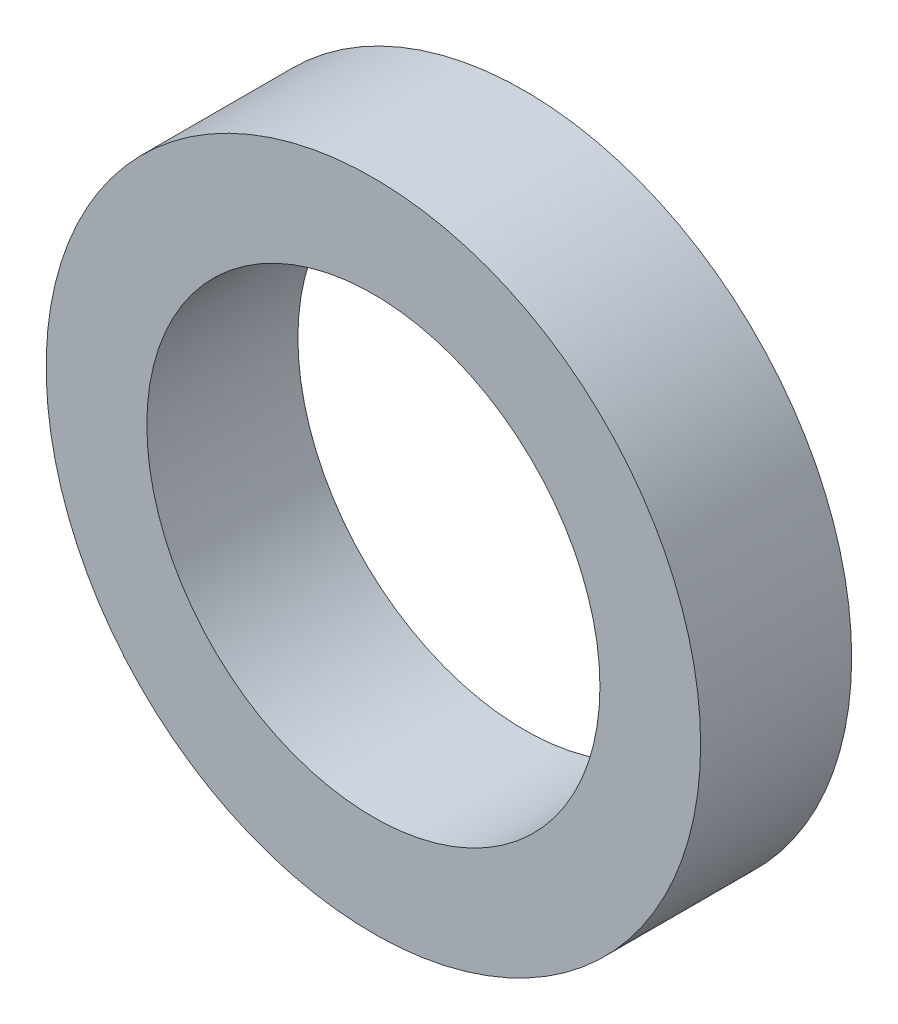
from build123d import *

# Parameters (mm, degrees)
SKETCH_1_W = 2
SKETCH_1_H = 3


with BuildPart() as part:
    # Sketch 1 → Revolve 1 (revolve)
    with BuildSketch(Plane(origin=(0, 0, 0), x_dir=(1, 0, 0), z_dir=(0, 1, 0)), mode=Mode.PRIVATE) as revolve_1_sk:
        with Locations((-5.5, 1.5)):
            Rectangle(SKETCH_1_W, SKETCH_1_H)
    revolve(revolve_1_sk.sketch.rotate(Axis((0, 0, 0), (0, 0, -1)), 180), axis=Axis((0, 0, 0), (0, 0, -1)))


solid = part.part
